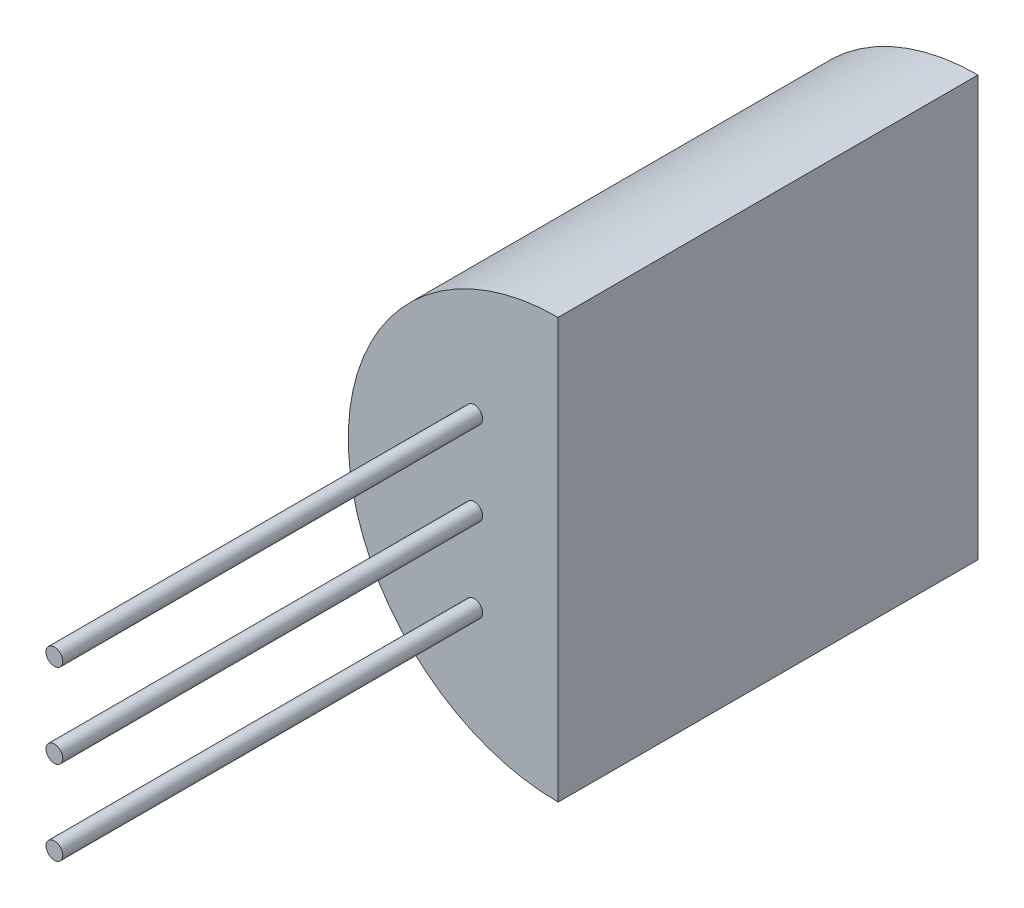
ISO-10303-21;
HEADER;
FILE_DESCRIPTION(('STEP AP214'),'2;1');
FILE_NAME('part.step','',(''),(''),'','','');
FILE_SCHEMA(('AUTOMOTIVE_DESIGN { 1 0 10303 214 1 1 1 1 }'));
ENDSEC;
DATA;
#1=APPLICATION_CONTEXT('core data for automotive mechanical design processes');
#2=APPLICATION_PROTOCOL_DEFINITION('international standard','automotive_design',2000,#1);
#3=PRODUCT_CONTEXT('',#1,'mechanical');
#4=PRODUCT('Part','Part','',(#3));
#5=PRODUCT_RELATED_PRODUCT_CATEGORY('part','',(#4));
#6=PRODUCT_DEFINITION_FORMATION('','',#4);
#7=PRODUCT_DEFINITION_CONTEXT('part definition',#1,'design');
#8=PRODUCT_DEFINITION('design','',#6,#7);
#9=PRODUCT_DEFINITION_SHAPE('','',#8);
#10=(LENGTH_UNIT() NAMED_UNIT(*) SI_UNIT(.MILLI.,.METRE.));
#11=(NAMED_UNIT(*) PLANE_ANGLE_UNIT() SI_UNIT($,.RADIAN.));
#12=(NAMED_UNIT(*) SI_UNIT($,.STERADIAN.) SOLID_ANGLE_UNIT());
#13=UNCERTAINTY_MEASURE_WITH_UNIT(LENGTH_MEASURE(1.E-05),#10,'distance_accuracy_value','');
#14=(GEOMETRIC_REPRESENTATION_CONTEXT(3) GLOBAL_UNCERTAINTY_ASSIGNED_CONTEXT((#13)) GLOBAL_UNIT_ASSIGNED_CONTEXT((#10,
#11,#12)) REPRESENTATION_CONTEXT('',''));
#15=CARTESIAN_POINT('',(0.,0.,0.));
#16=DIRECTION('',(0.,0.,1.));
#17=DIRECTION('',(1.,0.,0.));
#18=AXIS2_PLACEMENT_3D('',#15,#16,#17);
#19=CARTESIAN_POINT('',(-2.02394532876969,1.44898768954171,5.));
#20=DIRECTION('',(0.,0.,-1.));
#21=DIRECTION('',(-1.,0.,0.));
#22=AXIS2_PLACEMENT_3D('',#19,#20,#21);
#23=CYLINDRICAL_SURFACE('',#22,2.50000000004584);
#24=CARTESIAN_POINT('',(-2.02394532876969,1.44898768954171,5.));
#25=DIRECTION('',(0.,0.,1.));
#26=DIRECTION('',(1.,0.,0.));
#27=AXIS2_PLACEMENT_3D('',#24,#25,#26);
#28=CIRCLE('',#27,2.50000000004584);
#29=CARTESIAN_POINT('',(-2.02394532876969,3.94898768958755,5.));
#30=VERTEX_POINT('',#29);
#31=CARTESIAN_POINT('',(-2.02394532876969,-1.05101231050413,5.));
#32=VERTEX_POINT('',#31);
#33=EDGE_CURVE('E11',#30,#32,#28,.T.);
#34=ORIENTED_EDGE('',*,*,#33,.F.);
#35=DIRECTION('',(0.,0.,1.));
#36=VECTOR('',#35,1.);
#37=CARTESIAN_POINT('',(-2.02394532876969,3.94898768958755,0.));
#38=LINE('',#37,#36);
#39=CARTESIAN_POINT('',(-2.02394532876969,3.94898768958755,0.));
#40=VERTEX_POINT('',#39);
#41=EDGE_CURVE('E55',#40,#30,#38,.T.);
#42=ORIENTED_EDGE('',*,*,#41,.F.);
#43=CARTESIAN_POINT('',(-2.02394532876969,1.44898768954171,0.));
#44=DIRECTION('',(0.,0.,1.));
#45=DIRECTION('',(1.,0.,0.));
#46=AXIS2_PLACEMENT_3D('',#43,#44,#45);
#47=CIRCLE('',#46,2.50000000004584);
#48=CARTESIAN_POINT('',(-2.02394532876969,-1.05101231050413,0.));
#49=VERTEX_POINT('',#48);
#50=EDGE_CURVE('E35',#40,#49,#47,.T.);
#51=ORIENTED_EDGE('',*,*,#50,.T.);
#52=DIRECTION('',(0.,0.,1.));
#53=VECTOR('',#52,1.);
#54=CARTESIAN_POINT('',(-2.02394532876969,-1.05101231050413,0.));
#55=LINE('',#54,#53);
#56=EDGE_CURVE('E46',#49,#32,#55,.T.);
#57=ORIENTED_EDGE('',*,*,#56,.T.);
#58=EDGE_LOOP('',(#34,#42,#51,#57));
#59=FACE_BOUND('',#58,.T.);
#60=ADVANCED_FACE('F32',(#59),#23,.T.);
#61=CARTESIAN_POINT('',(-2.02394532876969,1.44898768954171,5.));
#62=DIRECTION('',(0.,0.,1.));
#63=DIRECTION('',(1.,0.,0.));
#64=AXIS2_PLACEMENT_3D('',#61,#62,#63);
#65=PLANE('',#64);
#66=CARTESIAN_POINT('',(-3.02394532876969,0.448987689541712,5.));
#67=DIRECTION('',(0.,0.,1.));
#68=DIRECTION('',(1.,0.,0.));
#69=AXIS2_PLACEMENT_3D('',#66,#67,#68);
#70=CIRCLE('',#69,0.0999999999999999);
#71=CARTESIAN_POINT('',(-2.92394532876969,0.448987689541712,5.));
#72=VERTEX_POINT('',#71);
#73=EDGE_CURVE('E83',#72,#72,#70,.T.);
#74=ORIENTED_EDGE('',*,*,#73,.F.);
#75=EDGE_LOOP('',(#74));
#76=FACE_BOUND('',#75,.T.);
#77=CARTESIAN_POINT('',(-3.02394532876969,1.44898768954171,5.));
#78=DIRECTION('',(0.,0.,1.));
#79=DIRECTION('',(1.,0.,0.));
#80=AXIS2_PLACEMENT_3D('',#77,#78,#79);
#81=CIRCLE('',#80,0.0999999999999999);
#82=CARTESIAN_POINT('',(-2.92394532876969,1.44898768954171,5.));
#83=VERTEX_POINT('',#82);
#84=EDGE_CURVE('E77',#83,#83,#81,.T.);
#85=ORIENTED_EDGE('',*,*,#84,.F.);
#86=EDGE_LOOP('',(#85));
#87=FACE_BOUND('',#86,.T.);
#88=CARTESIAN_POINT('',(-3.02394532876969,2.44898768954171,5.));
#89=DIRECTION('',(0.,0.,1.));
#90=DIRECTION('',(1.,0.,0.));
#91=AXIS2_PLACEMENT_3D('',#88,#89,#90);
#92=CIRCLE('',#91,0.0999999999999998);
#93=CARTESIAN_POINT('',(-2.92394532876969,2.44898768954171,5.));
#94=VERTEX_POINT('',#93);
#95=EDGE_CURVE('E71',#94,#94,#92,.T.);
#96=ORIENTED_EDGE('',*,*,#95,.F.);
#97=EDGE_LOOP('',(#96));
#98=FACE_BOUND('',#97,.T.);
#99=DIRECTION('',(0.,-1.,0.));
#100=VECTOR('',#99,1.);
#101=CARTESIAN_POINT('',(-2.02394532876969,0.,5.));
#102=LINE('',#101,#100);
#103=EDGE_CURVE('E58',#30,#32,#102,.T.);
#104=ORIENTED_EDGE('',*,*,#103,.F.);
#105=ORIENTED_EDGE('',*,*,#33,.T.);
#106=EDGE_LOOP('',(#104,#105));
#107=FACE_BOUND('',#106,.T.);
#108=ADVANCED_FACE('F65',(#76,#87,#98,#107),#65,.T.);
#109=CARTESIAN_POINT('',(-2.02394532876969,1.44898768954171,0.));
#110=DIRECTION('',(0.,0.,1.));
#111=DIRECTION('',(1.,0.,0.));
#112=AXIS2_PLACEMENT_3D('',#109,#110,#111);
#113=PLANE('',#112);
#114=ORIENTED_EDGE('',*,*,#50,.F.);
#115=DIRECTION('',(0.,-1.,0.));
#116=VECTOR('',#115,1.);
#117=CARTESIAN_POINT('',(-2.02394532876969,0.,0.));
#118=LINE('',#117,#116);
#119=EDGE_CURVE('E51',#40,#49,#118,.T.);
#120=ORIENTED_EDGE('',*,*,#119,.T.);
#121=EDGE_LOOP('',(#114,#120));
#122=FACE_BOUND('',#121,.T.);
#123=ADVANCED_FACE('F100',(#122),#113,.F.);
#124=CARTESIAN_POINT('',(-2.02394532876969,0.,0.));
#125=DIRECTION('',(-1.,0.,0.));
#126=DIRECTION('',(0.,0.,1.));
#127=AXIS2_PLACEMENT_3D('',#124,#125,#126);
#128=PLANE('',#127);
#129=ORIENTED_EDGE('',*,*,#103,.T.);
#130=ORIENTED_EDGE('',*,*,#56,.F.);
#131=ORIENTED_EDGE('',*,*,#119,.F.);
#132=ORIENTED_EDGE('',*,*,#41,.T.);
#133=EDGE_LOOP('',(#129,#130,#131,#132));
#134=FACE_BOUND('',#133,.T.);
#135=ADVANCED_FACE('F57',(#134),#128,.F.);
#136=CARTESIAN_POINT('',(-3.02394532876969,2.44898768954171,10.));
#137=DIRECTION('',(0.,0.,-1.));
#138=DIRECTION('',(-1.,0.,0.));
#139=AXIS2_PLACEMENT_3D('',#136,#137,#138);
#140=CYLINDRICAL_SURFACE('',#139,0.0999999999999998);
#141=CARTESIAN_POINT('',(-3.02394532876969,2.44898768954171,10.));
#142=DIRECTION('',(0.,0.,1.));
#143=DIRECTION('',(1.,0.,0.));
#144=AXIS2_PLACEMENT_3D('',#141,#142,#143);
#145=CIRCLE('',#144,0.0999999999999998);
#146=CARTESIAN_POINT('',(-2.92394532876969,2.44898768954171,10.));
#147=VERTEX_POINT('',#146);
#148=EDGE_CURVE('E66',#147,#147,#145,.T.);
#149=ORIENTED_EDGE('',*,*,#148,.F.);
#150=EDGE_LOOP('',(#149));
#151=FACE_BOUND('',#150,.T.);
#152=ORIENTED_EDGE('',*,*,#95,.T.);
#153=EDGE_LOOP('',(#152));
#154=FACE_BOUND('',#153,.T.);
#155=ADVANCED_FACE('F106',(#151,#154),#140,.T.);
#156=CARTESIAN_POINT('',(-3.02394532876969,2.44898768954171,10.));
#157=DIRECTION('',(0.,0.,1.));
#158=DIRECTION('',(1.,0.,0.));
#159=AXIS2_PLACEMENT_3D('',#156,#157,#158);
#160=PLANE('',#159);
#161=ORIENTED_EDGE('',*,*,#148,.T.);
#162=EDGE_LOOP('',(#161));
#163=FACE_BOUND('',#162,.T.);
#164=ADVANCED_FACE('F108',(#163),#160,.T.);
#165=CARTESIAN_POINT('',(-3.02394532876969,1.44898768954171,10.));
#166=DIRECTION('',(0.,0.,-1.));
#167=DIRECTION('',(-1.,0.,0.));
#168=AXIS2_PLACEMENT_3D('',#165,#166,#167);
#169=CYLINDRICAL_SURFACE('',#168,0.0999999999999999);
#170=CARTESIAN_POINT('',(-3.02394532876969,1.44898768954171,10.));
#171=DIRECTION('',(0.,0.,1.));
#172=DIRECTION('',(1.,0.,0.));
#173=AXIS2_PLACEMENT_3D('',#170,#171,#172);
#174=CIRCLE('',#173,0.0999999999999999);
#175=CARTESIAN_POINT('',(-2.92394532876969,1.44898768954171,10.));
#176=VERTEX_POINT('',#175);
#177=EDGE_CURVE('E74',#176,#176,#174,.T.);
#178=ORIENTED_EDGE('',*,*,#177,.F.);
#179=EDGE_LOOP('',(#178));
#180=FACE_BOUND('',#179,.T.);
#181=ORIENTED_EDGE('',*,*,#84,.T.);
#182=EDGE_LOOP('',(#181));
#183=FACE_BOUND('',#182,.T.);
#184=ADVANCED_FACE('F115',(#180,#183),#169,.T.);
#185=CARTESIAN_POINT('',(-3.02394532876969,1.44898768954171,10.));
#186=DIRECTION('',(0.,0.,1.));
#187=DIRECTION('',(1.,0.,0.));
#188=AXIS2_PLACEMENT_3D('',#185,#186,#187);
#189=PLANE('',#188);
#190=ORIENTED_EDGE('',*,*,#177,.T.);
#191=EDGE_LOOP('',(#190));
#192=FACE_BOUND('',#191,.T.);
#193=ADVANCED_FACE('F94',(#192),#189,.T.);
#194=CARTESIAN_POINT('',(-3.02394532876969,0.448987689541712,10.));
#195=DIRECTION('',(0.,0.,-1.));
#196=DIRECTION('',(-1.,0.,0.));
#197=AXIS2_PLACEMENT_3D('',#194,#195,#196);
#198=CYLINDRICAL_SURFACE('',#197,0.0999999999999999);
#199=CARTESIAN_POINT('',(-3.02394532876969,0.448987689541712,10.));
#200=DIRECTION('',(0.,0.,1.));
#201=DIRECTION('',(1.,0.,0.));
#202=AXIS2_PLACEMENT_3D('',#199,#200,#201);
#203=CIRCLE('',#202,0.0999999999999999);
#204=CARTESIAN_POINT('',(-2.92394532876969,0.448987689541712,10.));
#205=VERTEX_POINT('',#204);
#206=EDGE_CURVE('E80',#205,#205,#203,.T.);
#207=ORIENTED_EDGE('',*,*,#206,.F.);
#208=EDGE_LOOP('',(#207));
#209=FACE_BOUND('',#208,.T.);
#210=ORIENTED_EDGE('',*,*,#73,.T.);
#211=EDGE_LOOP('',(#210));
#212=FACE_BOUND('',#211,.T.);
#213=ADVANCED_FACE('F91',(#209,#212),#198,.T.);
#214=CARTESIAN_POINT('',(-3.02394532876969,0.448987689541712,10.));
#215=DIRECTION('',(0.,0.,1.));
#216=DIRECTION('',(1.,0.,0.));
#217=AXIS2_PLACEMENT_3D('',#214,#215,#216);
#218=PLANE('',#217);
#219=ORIENTED_EDGE('',*,*,#206,.T.);
#220=EDGE_LOOP('',(#219));
#221=FACE_BOUND('',#220,.T.);
#222=ADVANCED_FACE('F89',(#221),#218,.T.);
#223=CLOSED_SHELL('',(#60,#108,#123,#135,#155,#164,#184,#193,#213,#222));
#224=MANIFOLD_SOLID_BREP('B2',#223);
#225=ADVANCED_BREP_SHAPE_REPRESENTATION('',(#18,#224),#14);
#226=SHAPE_DEFINITION_REPRESENTATION(#9,#225);
ENDSEC;
END-ISO-10303-21;
